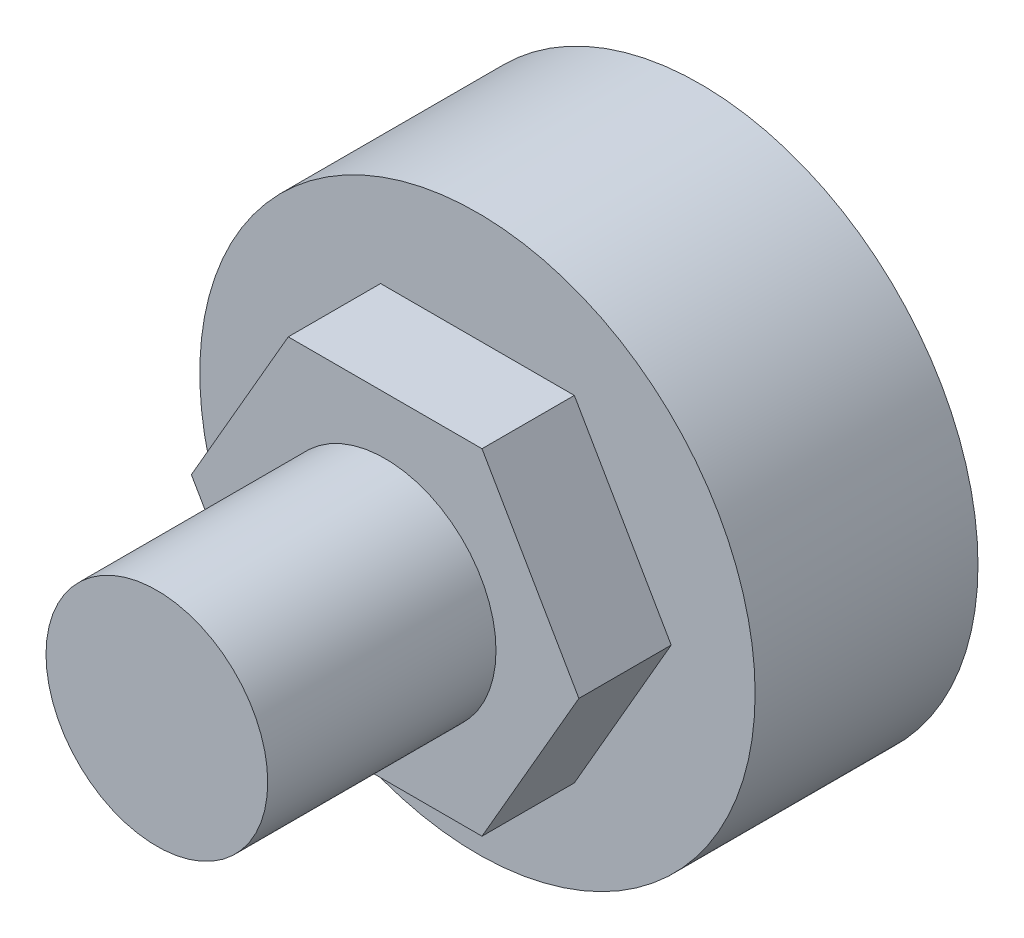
from build123d import *

# Parameters (mm, degrees)
SKETCH1_R           = 9.805
BOSS_EXTRUDE1_DEPTH = 7.87
BOSS_EXTRUDE2_DEPTH = 3.26
SKETCH3_R           = 3.915
BOSS_EXTRUDE3_DEPTH = 8.06


with BuildPart() as part:
    # Sketch1 → Boss-Extrude1 (new body)
    with BuildSketch(Plane.XY):
        Circle(SKETCH1_R)
    extrude(amount=BOSS_EXTRUDE1_DEPTH)

    # Sketch2 → Boss-Extrude2 (add)
    with BuildSketch(Plane.XY.offset(7.87)):
        Polygon((3.420800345, 5.925), (-3.420800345, 5.925), (-6.84160069, 0), (-3.420800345, -5.925), (3.420800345, -5.925), (6.84160069, 0), align=None)
    extrude(amount=BOSS_EXTRUDE2_DEPTH)

    # Sketch3 → Boss-Extrude3 (add)
    with BuildSketch(Plane.XY.offset(11.13)):
        Circle(SKETCH3_R)
    extrude(amount=BOSS_EXTRUDE3_DEPTH)


solid = part.part
